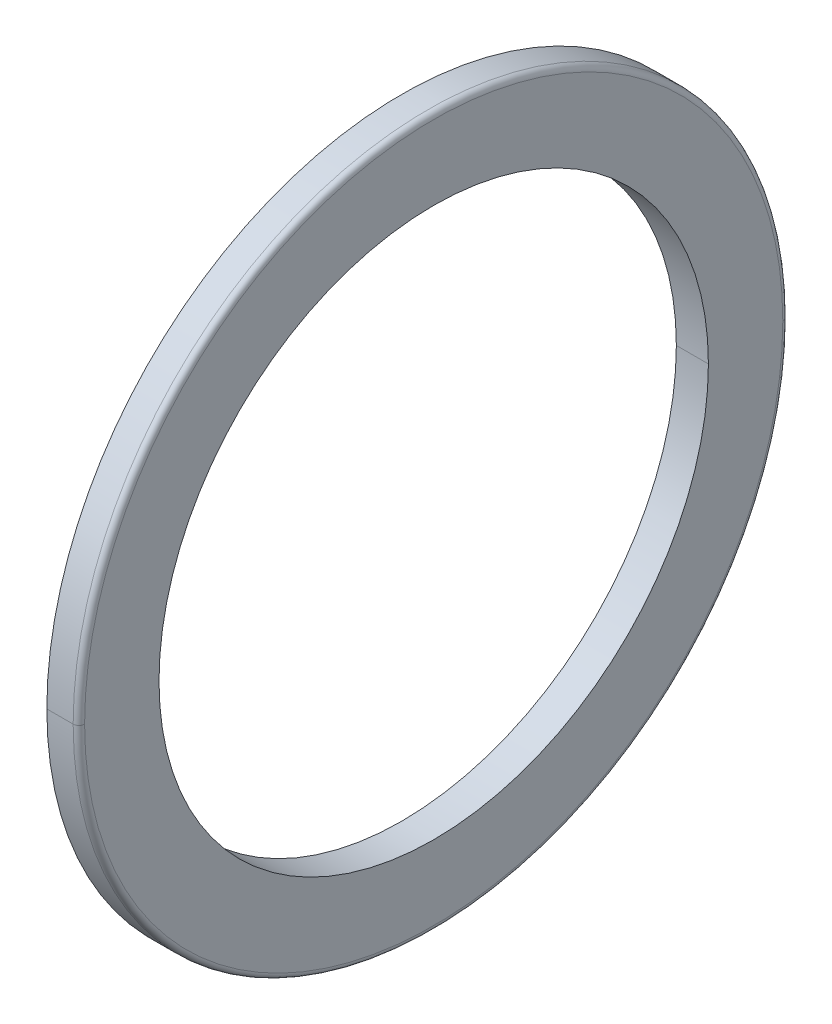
ISO-10303-21;
HEADER;
FILE_DESCRIPTION(('STEP AP214'),'2;1');
FILE_NAME('part.step','',(''),(''),'','','');
FILE_SCHEMA(('AUTOMOTIVE_DESIGN { 1 0 10303 214 1 1 1 1 }'));
ENDSEC;
DATA;
#1=APPLICATION_CONTEXT('core data for automotive mechanical design processes');
#2=APPLICATION_PROTOCOL_DEFINITION('international standard','automotive_design',2000,#1);
#3=PRODUCT_CONTEXT('',#1,'mechanical');
#4=PRODUCT('Part','Part','',(#3));
#5=PRODUCT_RELATED_PRODUCT_CATEGORY('part','',(#4));
#6=PRODUCT_DEFINITION_FORMATION('','',#4);
#7=PRODUCT_DEFINITION_CONTEXT('part definition',#1,'design');
#8=PRODUCT_DEFINITION('design','',#6,#7);
#9=PRODUCT_DEFINITION_SHAPE('','',#8);
#10=(LENGTH_UNIT() NAMED_UNIT(*) SI_UNIT(.MILLI.,.METRE.));
#11=(NAMED_UNIT(*) PLANE_ANGLE_UNIT() SI_UNIT($,.RADIAN.));
#12=(NAMED_UNIT(*) SI_UNIT($,.STERADIAN.) SOLID_ANGLE_UNIT());
#13=UNCERTAINTY_MEASURE_WITH_UNIT(LENGTH_MEASURE(1.E-05),#10,'distance_accuracy_value','');
#14=(GEOMETRIC_REPRESENTATION_CONTEXT(3) GLOBAL_UNCERTAINTY_ASSIGNED_CONTEXT((#13)) GLOBAL_UNIT_ASSIGNED_CONTEXT((#10,
#11,#12)) REPRESENTATION_CONTEXT('',''));
#15=CARTESIAN_POINT('',(0.,0.,0.));
#16=DIRECTION('',(0.,0.,1.));
#17=DIRECTION('',(1.,0.,0.));
#18=AXIS2_PLACEMENT_3D('',#15,#16,#17);
#19=CARTESIAN_POINT('',(7.,0.,0.));
#20=DIRECTION('',(-1.,0.,0.));
#21=DIRECTION('',(0.,1.,0.));
#22=AXIS2_PLACEMENT_3D('',#19,#20,#21);
#23=CYLINDRICAL_SURFACE('',#22,77.5);
#24=CARTESIAN_POINT('',(18.,0.,0.));
#25=DIRECTION('',(1.,0.,0.));
#26=DIRECTION('',(0.,0.,-1.));
#27=AXIS2_PLACEMENT_3D('',#24,#25,#26);
#28=CIRCLE('',#27,77.5);
#29=CARTESIAN_POINT('',(18.,0.,77.5));
#30=VERTEX_POINT('',#29);
#31=CARTESIAN_POINT('',(18.,0.,-77.5));
#32=VERTEX_POINT('',#31);
#33=EDGE_CURVE('E11',#30,#32,#28,.T.);
#34=ORIENTED_EDGE('',*,*,#33,.T.);
#35=CARTESIAN_POINT('',(23.7499999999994,0.,-77.5));
#36=DIRECTION('',(-1.,0.,0.));
#37=VECTOR('',#36,1.);
#38=LINE('',#35,#37);
#39=CARTESIAN_POINT('',(23.7499999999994,0.,-77.5));
#40=VERTEX_POINT('',#39);
#41=EDGE_CURVE('E26',#40,#32,#38,.T.);
#42=ORIENTED_EDGE('',*,*,#41,.F.);
#43=CARTESIAN_POINT('',(23.7499999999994,0.,0.));
#44=DIRECTION('',(1.,0.,0.));
#45=DIRECTION('',(0.,0.,-1.));
#46=AXIS2_PLACEMENT_3D('',#43,#44,#45);
#47=CIRCLE('',#46,77.5);
#48=CARTESIAN_POINT('',(23.7499999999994,0.,77.5));
#49=VERTEX_POINT('',#48);
#50=EDGE_CURVE('E75',#49,#40,#47,.T.);
#51=ORIENTED_EDGE('',*,*,#50,.F.);
#52=CARTESIAN_POINT('',(23.7499999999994,0.,77.5));
#53=DIRECTION('',(-1.,0.,0.));
#54=VECTOR('',#53,1.);
#55=LINE('',#52,#54);
#56=EDGE_CURVE('E195',#49,#30,#55,.T.);
#57=ORIENTED_EDGE('',*,*,#56,.T.);
#58=EDGE_LOOP('',(#34,#42,#51,#57));
#59=FACE_BOUND('',#58,.T.);
#60=ADVANCED_FACE('F17',(#59),#23,.T.);
#61=CARTESIAN_POINT('',(7.,0.,0.));
#62=DIRECTION('',(-1.,0.,0.));
#63=DIRECTION('',(0.,-1.,0.));
#64=AXIS2_PLACEMENT_3D('',#61,#62,#63);
#65=CYLINDRICAL_SURFACE('',#64,77.5);
#66=CARTESIAN_POINT('',(23.7499999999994,0.,0.));
#67=DIRECTION('',(1.,0.,0.));
#68=DIRECTION('',(0.,0.,-1.));
#69=AXIS2_PLACEMENT_3D('',#66,#67,#68);
#70=CIRCLE('',#69,77.5);
#71=EDGE_CURVE('E193',#40,#49,#70,.T.);
#72=ORIENTED_EDGE('',*,*,#71,.F.);
#73=ORIENTED_EDGE('',*,*,#41,.T.);
#74=CARTESIAN_POINT('',(18.,0.,0.));
#75=DIRECTION('',(1.,0.,0.));
#76=DIRECTION('',(0.,0.,-1.));
#77=AXIS2_PLACEMENT_3D('',#74,#75,#76);
#78=CIRCLE('',#77,77.5);
#79=EDGE_CURVE('E160',#32,#30,#78,.T.);
#80=ORIENTED_EDGE('',*,*,#79,.T.);
#81=ORIENTED_EDGE('',*,*,#56,.F.);
#82=EDGE_LOOP('',(#72,#73,#80,#81));
#83=FACE_BOUND('',#82,.T.);
#84=ADVANCED_FACE('F168',(#83),#65,.T.);
#85=CARTESIAN_POINT('',(18.,77.5,0.));
#86=DIRECTION('',(-1.,0.,0.));
#87=DIRECTION('',(0.,0.,1.));
#88=AXIS2_PLACEMENT_3D('',#85,#86,#87);
#89=PLANE('',#88);
#90=CARTESIAN_POINT('',(18.,0.,0.));
#91=DIRECTION('',(1.,0.,0.));
#92=DIRECTION('',(0.,0.,-1.));
#93=AXIS2_PLACEMENT_3D('',#90,#91,#92);
#94=CIRCLE('',#93,60.);
#95=CARTESIAN_POINT('',(18.,0.,-60.));
#96=VERTEX_POINT('',#95);
#97=CARTESIAN_POINT('',(18.,0.,60.));
#98=VERTEX_POINT('',#97);
#99=EDGE_CURVE('E156',#96,#98,#94,.T.);
#100=ORIENTED_EDGE('',*,*,#99,.T.);
#101=CARTESIAN_POINT('',(18.,0.,0.));
#102=DIRECTION('',(1.,0.,0.));
#103=DIRECTION('',(0.,0.,-1.));
#104=AXIS2_PLACEMENT_3D('',#101,#102,#103);
#105=CIRCLE('',#104,60.);
#106=EDGE_CURVE('E154',#98,#96,#105,.T.);
#107=ORIENTED_EDGE('',*,*,#106,.T.);
#108=EDGE_LOOP('',(#100,#107));
#109=FACE_BOUND('',#108,.T.);
#110=ORIENTED_EDGE('',*,*,#79,.F.);
#111=ORIENTED_EDGE('',*,*,#33,.F.);
#112=EDGE_LOOP('',(#110,#111));
#113=FACE_BOUND('',#112,.T.);
#114=ADVANCED_FACE('F176',(#109,#113),#89,.T.);
#115=CARTESIAN_POINT('',(7.,0.,0.));
#116=DIRECTION('',(-1.,0.,0.));
#117=DIRECTION('',(0.,1.,0.));
#118=AXIS2_PLACEMENT_3D('',#115,#116,#117);
#119=CYLINDRICAL_SURFACE('',#118,60.);
#120=ORIENTED_EDGE('',*,*,#106,.F.);
#121=CARTESIAN_POINT('',(25.,0.,60.));
#122=DIRECTION('',(-1.,0.,0.));
#123=VECTOR('',#122,1.);
#124=LINE('',#121,#123);
#125=CARTESIAN_POINT('',(25.,0.,60.));
#126=VERTEX_POINT('',#125);
#127=EDGE_CURVE('E125',#126,#98,#124,.T.);
#128=ORIENTED_EDGE('',*,*,#127,.F.);
#129=CARTESIAN_POINT('',(25.,0.,0.));
#130=DIRECTION('',(1.,0.,0.));
#131=DIRECTION('',(0.,0.,-1.));
#132=AXIS2_PLACEMENT_3D('',#129,#130,#131);
#133=CIRCLE('',#132,60.);
#134=CARTESIAN_POINT('',(25.,0.,-60.));
#135=VERTEX_POINT('',#134);
#136=EDGE_CURVE('E141',#126,#135,#133,.T.);
#137=ORIENTED_EDGE('',*,*,#136,.T.);
#138=CARTESIAN_POINT('',(25.,0.,-60.));
#139=DIRECTION('',(-1.,0.,0.));
#140=VECTOR('',#139,1.);
#141=LINE('',#138,#140);
#142=EDGE_CURVE('E86',#135,#96,#141,.T.);
#143=ORIENTED_EDGE('',*,*,#142,.T.);
#144=EDGE_LOOP('',(#120,#128,#137,#143));
#145=FACE_BOUND('',#144,.T.);
#146=ADVANCED_FACE('F109',(#145),#119,.F.);
#147=CARTESIAN_POINT('',(7.,0.,0.));
#148=DIRECTION('',(-1.,0.,0.));
#149=DIRECTION('',(0.,-1.,0.));
#150=AXIS2_PLACEMENT_3D('',#147,#148,#149);
#151=CYLINDRICAL_SURFACE('',#150,60.);
#152=CARTESIAN_POINT('',(25.,0.,0.));
#153=DIRECTION('',(1.,0.,0.));
#154=DIRECTION('',(0.,0.,-1.));
#155=AXIS2_PLACEMENT_3D('',#152,#153,#154);
#156=CIRCLE('',#155,60.);
#157=EDGE_CURVE('E83',#135,#126,#156,.T.);
#158=ORIENTED_EDGE('',*,*,#157,.T.);
#159=ORIENTED_EDGE('',*,*,#127,.T.);
#160=ORIENTED_EDGE('',*,*,#99,.F.);
#161=ORIENTED_EDGE('',*,*,#142,.F.);
#162=EDGE_LOOP('',(#158,#159,#160,#161));
#163=FACE_BOUND('',#162,.T.);
#164=ADVANCED_FACE('F99',(#163),#151,.F.);
#165=CARTESIAN_POINT('',(25.,60.,0.));
#166=DIRECTION('',(1.,0.,0.));
#167=DIRECTION('',(0.,0.,-1.));
#168=AXIS2_PLACEMENT_3D('',#165,#166,#167);
#169=PLANE('',#168);
#170=CARTESIAN_POINT('',(25.,0.,0.));
#171=DIRECTION('',(1.,0.,0.));
#172=DIRECTION('',(0.,0.,-1.));
#173=AXIS2_PLACEMENT_3D('',#170,#171,#172);
#174=CIRCLE('',#173,76.25);
#175=CARTESIAN_POINT('',(25.,0.,-76.25));
#176=VERTEX_POINT('',#175);
#177=CARTESIAN_POINT('',(25.,0.,76.25));
#178=VERTEX_POINT('',#177);
#179=EDGE_CURVE('E65',#176,#178,#174,.T.);
#180=ORIENTED_EDGE('',*,*,#179,.T.);
#181=CARTESIAN_POINT('',(25.,0.,0.));
#182=DIRECTION('',(1.,0.,0.));
#183=DIRECTION('',(0.,0.,-1.));
#184=AXIS2_PLACEMENT_3D('',#181,#182,#183);
#185=CIRCLE('',#184,76.25);
#186=EDGE_CURVE('E60',#178,#176,#185,.T.);
#187=ORIENTED_EDGE('',*,*,#186,.T.);
#188=EDGE_LOOP('',(#180,#187));
#189=FACE_BOUND('',#188,.T.);
#190=ORIENTED_EDGE('',*,*,#157,.F.);
#191=ORIENTED_EDGE('',*,*,#136,.F.);
#192=EDGE_LOOP('',(#190,#191));
#193=FACE_BOUND('',#192,.T.);
#194=ADVANCED_FACE('F62',(#189,#193),#169,.T.);
#195=CARTESIAN_POINT('',(23.7499999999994,0.,0.));
#196=DIRECTION('',(1.,0.,0.));
#197=DIRECTION('',(0.,1.,0.));
#198=AXIS2_PLACEMENT_3D('',#195,#196,#197);
#199=TOROIDAL_SURFACE('',#198,76.2499999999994,1.25000000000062);
#200=ORIENTED_EDGE('',*,*,#50,.T.);
#201=CARTESIAN_POINT('',(23.7499999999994,-2.08275051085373E-13,-77.5));
#202=CARTESIAN_POINT('',(23.7704530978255,-2.28040170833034E-13,-77.500000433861));
#203=CARTESIAN_POINT('',(23.7909061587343,-2.18156261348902E-13,-77.4994980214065));
#204=CARTESIAN_POINT('',(23.831763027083,-1.9838574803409E-13,-77.4974906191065));
#205=CARTESIAN_POINT('',(23.852166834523,-1.88499144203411E-13,-77.4959856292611));
#206=CARTESIAN_POINT('',(23.8928760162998,-2.2801860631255E-13,-77.4919761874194));
#207=CARTESIAN_POINT('',(23.9131813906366,-2.77424672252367E-13,-77.4894717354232));
#208=CARTESIAN_POINT('',(23.9536447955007,-2.76696333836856E-13,-77.4834695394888));
#209=CARTESIAN_POINT('',(23.9738028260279,-2.26561929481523E-13,-77.4799717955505));
#210=CARTESIAN_POINT('',(24.0139229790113,-1.89859077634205E-13,-77.4719914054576));
#211=CARTESIAN_POINT('',(24.0338851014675,-2.03290630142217E-13,-77.4675087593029));
#212=CARTESIAN_POINT('',(24.0735653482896,-2.1305812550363E-13,-77.4575693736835));
#213=CARTESIAN_POINT('',(24.0932834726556,-2.09394068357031E-13,-77.4521126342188));
#214=CARTESIAN_POINT('',(24.1324282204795,-2.06866735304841E-13,-77.4402382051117));
#215=CARTESIAN_POINT('',(24.1518548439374,-2.08003459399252E-13,-77.4338205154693));
#216=CARTESIAN_POINT('',(24.1903697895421,-2.08153903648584E-13,-77.4200396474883));
#217=CARTESIAN_POINT('',(24.2094581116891,-2.07167623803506E-13,-77.4126764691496));
#218=CARTESIAN_POINT('',(24.2472504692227,-2.08871059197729E-13,-77.3970223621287));
#219=CARTESIAN_POINT('',(24.2659545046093,-2.1156077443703E-13,-77.3887314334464));
#220=CARTESIAN_POINT('',(24.3029332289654,-2.04344274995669E-13,-77.3712417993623));
#221=CARTESIAN_POINT('',(24.3212079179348,-1.94438060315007E-13,-77.3620430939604));
#222=CARTESIAN_POINT('',(24.3572839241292,-2.21318723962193E-13,-77.3427600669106));
#223=CARTESIAN_POINT('',(24.3750852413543,-2.5810560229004E-13,-77.3326757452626));
#224=CARTESIAN_POINT('',(24.4101716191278,-2.94840391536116E-13,-77.3116457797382));
#225=CARTESIAN_POINT('',(24.4274566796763,-2.94788302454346E-13,-77.3007001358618));
#226=CARTESIAN_POINT('',(24.4614689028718,-2.57922962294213E-13,-77.2779738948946));
#227=CARTESIAN_POINT('',(24.4781960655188,-2.21109711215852E-13,-77.2661932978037));
#228=CARTESIAN_POINT('',(24.5110521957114,-1.94118230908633E-13,-77.241825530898));
#229=CARTESIAN_POINT('',(24.527181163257,-2.0394000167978E-13,-77.2292383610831));
#230=CARTESIAN_POINT('',(24.5588020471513,-2.11085059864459E-13,-77.2032877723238));
#231=CARTESIAN_POINT('',(24.5742939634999,-2.08408347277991E-13,-77.1899243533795));
#232=CARTESIAN_POINT('',(24.6046034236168,-2.0640132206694E-13,-77.162453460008));
#233=CARTESIAN_POINT('',(24.6194209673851,-2.07071009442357E-13,-77.1483459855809));
#234=CARTESIAN_POINT('',(24.6483459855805,-2.07511274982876E-13,-77.1194209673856));
#235=CARTESIAN_POINT('',(24.6624534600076,-2.07281853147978E-13,-77.1046034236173));
#236=CARTESIAN_POINT('',(24.6899243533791,-2.07061601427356E-13,-77.0742939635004));
#237=CARTESIAN_POINT('',(24.7032877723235,-2.07070771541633E-13,-77.0588020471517));
#238=CARTESIAN_POINT('',(24.7292383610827,-2.07022983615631E-13,-77.0271811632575));
#239=CARTESIAN_POINT('',(24.7418255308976,-2.06966025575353E-13,-77.0110521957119));
#240=CARTESIAN_POINT('',(24.7661932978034,-2.06867762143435E-13,-76.9781960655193));
#241=CARTESIAN_POINT('',(24.7779738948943,-2.06826456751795E-13,-76.9614689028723));
#242=CARTESIAN_POINT('',(24.8007001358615,-2.06737721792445E-13,-76.9274566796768));
#243=CARTESIAN_POINT('',(24.8116457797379,-2.06690292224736E-13,-76.9101716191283));
#244=CARTESIAN_POINT('',(24.8326757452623,-2.06595284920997E-13,-76.8750852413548));
#245=CARTESIAN_POINT('',(24.8427600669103,-2.06547707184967E-13,-76.8572839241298));
#246=CARTESIAN_POINT('',(24.8620430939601,-2.06450947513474E-13,-76.8212079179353));
#247=CARTESIAN_POINT('',(24.871241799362,-2.06401765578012E-13,-76.8029332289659));
#248=CARTESIAN_POINT('',(24.8887314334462,-2.06302336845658E-13,-76.7659545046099));
#249=CARTESIAN_POINT('',(24.8970223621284,-2.06252090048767E-13,-76.7472504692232));
#250=CARTESIAN_POINT('',(24.9126764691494,-2.06150539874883E-13,-76.7094581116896));
#251=CARTESIAN_POINT('',(24.9200396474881,-2.06099236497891E-13,-76.6903697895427));
#252=CARTESIAN_POINT('',(24.9338205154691,-2.05995726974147E-13,-76.6518548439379));
#253=CARTESIAN_POINT('',(24.9402382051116,-2.05943520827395E-13,-76.6324282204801));
#254=CARTESIAN_POINT('',(24.9521126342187,-2.05838323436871E-13,-76.5932834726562));
#255=CARTESIAN_POINT('',(24.9575693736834,-2.05785332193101E-13,-76.5735653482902));
#256=CARTESIAN_POINT('',(24.9675087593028,-2.0567869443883E-13,-76.533885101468));
#257=CARTESIAN_POINT('',(24.9719914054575,-2.05625047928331E-13,-76.5139229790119));
#258=CARTESIAN_POINT('',(24.9799717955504,-2.05517228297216E-13,-76.4738028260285));
#259=CARTESIAN_POINT('',(24.9834695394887,-2.054630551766E-13,-76.4536447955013));
#260=CARTESIAN_POINT('',(24.9894717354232,-2.05354312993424E-13,-76.4131813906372));
#261=CARTESIAN_POINT('',(24.9919761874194,-2.05299743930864E-13,-76.3928760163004));
#262=CARTESIAN_POINT('',(24.995985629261,-2.05190341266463E-13,-76.3521668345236));
#263=CARTESIAN_POINT('',(24.9974906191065,-2.05135507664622E-13,-76.3317630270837));
#264=CARTESIAN_POINT('',(24.9994980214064,-2.05025708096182E-13,-76.2909061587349));
#265=CARTESIAN_POINT('',(25.000000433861,-2.04970742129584E-13,-76.2704530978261));
#266=CARTESIAN_POINT('',(25.,-2.04915776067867E-13,-76.25));
#267=B_SPLINE_CURVE_WITH_KNOTS('',3,(#201,#202,#203,#204,#205,#206,#207,#208,#209,#210,#211,
#212,#213,#214,#215,#216,#217,#218,#219,#220,#221,#222,#223,#224,#225,#226,#227,#228,#229,#230,
#231,#232,#233,#234,#235,#236,#237,#238,#239,#240,#241,#242,#243,#244,#245,#246,#247,#248,#249,
#250,#251,#252,#253,#254,#255,#256,#257,#258,#259,#260,#261,#262,#263,#264,#265,#266),
.UNSPECIFIED.,.F.,.F.,(4,2,2,2,2,2,2,2,2,2,2,2,2,2,2,2,2,2,2,2,2,2,2,2,2,2,2,2,2,2,2,2,4),(0.,
0.0613530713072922,0.122706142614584,0.184059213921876,0.245412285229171,0.306765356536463,
0.368118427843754,0.42947149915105,0.490824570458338,0.552177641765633,0.613530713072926,
0.674883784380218,0.736236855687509,0.797589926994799,0.858942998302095,0.920296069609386,
0.981649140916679,1.04300221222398,1.10435528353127,1.16570835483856,1.22706142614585,
1.28841449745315,1.34976756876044,1.41112064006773,1.47247371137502,1.53382678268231,
1.59517985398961,1.6565329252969,1.7178859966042,1.77923906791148,1.84059213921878,
1.90194521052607,1.96329828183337),.UNSPECIFIED.);
#268=EDGE_CURVE('E69',#40,#176,#267,.T.);
#269=ORIENTED_EDGE('',*,*,#268,.T.);
#270=ORIENTED_EDGE('',*,*,#186,.F.);
#271=CARTESIAN_POINT('',(23.7499999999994,1.29950210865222E-13,77.5));
#272=CARTESIAN_POINT('',(23.7704530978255,1.29950246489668E-13,77.500000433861));
#273=CARTESIAN_POINT('',(23.7909061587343,1.29949386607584E-13,77.4994980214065));
#274=CARTESIAN_POINT('',(23.831763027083,1.29945985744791E-13,77.4974906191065));
#275=CARTESIAN_POINT('',(23.852166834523,1.29943444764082E-13,77.4959856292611));
#276=CARTESIAN_POINT('',(23.8928760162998,1.2993679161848E-13,77.4919761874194));
#277=CARTESIAN_POINT('',(23.9131813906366,1.29932679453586E-13,77.4894717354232));
#278=CARTESIAN_POINT('',(23.9536447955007,1.29922370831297E-13,77.4834695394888));
#279=CARTESIAN_POINT('',(23.9738028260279,1.29916174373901E-13,77.4799717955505));
#280=CARTESIAN_POINT('',(24.0139229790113,1.29903700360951E-13,77.4719914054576));
#281=CARTESIAN_POINT('',(24.0338851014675,1.29897422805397E-13,77.4675087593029));
#282=CARTESIAN_POINT('',(24.0735653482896,1.29877371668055E-13,77.4575693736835));
#283=CARTESIAN_POINT('',(24.0932834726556,1.29863598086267E-13,77.4521126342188));
#284=CARTESIAN_POINT('',(24.1324282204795,1.29856320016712E-13,77.4402382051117));
#285=CARTESIAN_POINT('',(24.1518548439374,1.29862815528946E-13,77.4338205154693));
#286=CARTESIAN_POINT('',(24.1903697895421,1.29792562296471E-13,77.4200396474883));
#287=CARTESIAN_POINT('',(24.2094581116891,1.29715813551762E-13,77.4126764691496));
#288=CARTESIAN_POINT('',(24.2472504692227,1.29865515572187E-13,77.3970223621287));
#289=CARTESIAN_POINT('',(24.2659545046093,1.30091966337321E-13,77.3887314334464));
#290=CARTESIAN_POINT('',(24.3029332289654,1.2940598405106E-13,77.3712417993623));
#291=CARTESIAN_POINT('',(24.3212079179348,1.28493550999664E-13,77.3620430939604));
#292=CARTESIAN_POINT('',(24.3572839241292,1.30911891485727E-13,77.3427600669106));
#293=CARTESIAN_POINT('',(24.3750852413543,1.34242665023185E-13,77.3326757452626));
#294=CARTESIAN_POINT('',(24.4101716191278,1.25061363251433E-13,77.3116457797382));
#295=CARTESIAN_POINT('',(24.4274566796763,1.12549287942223E-13,77.3007001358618));
#296=CARTESIAN_POINT('',(24.4614689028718,1.46644664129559E-13,77.2779738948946));
#297=CARTESIAN_POINT('',(24.4781960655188,1.93252115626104E-13,77.2661932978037));
#298=CARTESIAN_POINT('',(24.5110521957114,2.03054051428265E-13,77.241825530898));
#299=CARTESIAN_POINT('',(24.527181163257,1.66248535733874E-13,77.2292383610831));
#300=CARTESIAN_POINT('',(24.5588020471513,0.,77.2032877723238));
#301=CARTESIAN_POINT('',(24.5742939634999,0.,77.1899243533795));
#302=CARTESIAN_POINT('',(24.6046034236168,0.,77.162453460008));
#303=CARTESIAN_POINT('',(24.6194209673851,1.12313673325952E-13,77.1483459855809));
#304=CARTESIAN_POINT('',(24.6483459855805,1.46358956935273E-13,77.1194209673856));
#305=CARTESIAN_POINT('',(24.6624534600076,1.33854922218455E-13,77.1046034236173));
#306=CARTESIAN_POINT('',(24.6899243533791,1.24668693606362E-13,77.0742939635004));
#307=CARTESIAN_POINT('',(24.7032877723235,1.27986499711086E-13,77.0588020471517));
#308=CARTESIAN_POINT('',(24.7292383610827,1.30381319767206E-13,77.0271811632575));
#309=CARTESIAN_POINT('',(24.7418255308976,1.29458333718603E-13,77.0110521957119));
#310=CARTESIAN_POINT('',(24.7661932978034,1.28747282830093E-13,76.9781960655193));
#311=CARTESIAN_POINT('',(24.7779738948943,1.28959217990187E-13,76.9614689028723));
#312=CARTESIAN_POINT('',(24.8007001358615,1.29078179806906E-13,76.9274566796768));
#313=CARTESIAN_POINT('',(24.8116457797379,1.28985206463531E-13,76.9101716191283));
#314=CARTESIAN_POINT('',(24.8326757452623,1.28878362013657E-13,76.8750852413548));
#315=CARTESIAN_POINT('',(24.8427600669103,1.28864490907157E-13,76.8572839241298));
#316=CARTESIAN_POINT('',(24.8620430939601,1.28820056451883E-13,76.8212079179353));
#317=CARTESIAN_POINT('',(24.871241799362,1.28789493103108E-13,76.8029332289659));
#318=CARTESIAN_POINT('',(24.8887314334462,1.28711272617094E-13,76.7659545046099));
#319=CARTESIAN_POINT('',(24.8970223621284,1.28663615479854E-13,76.7472504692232));
#320=CARTESIAN_POINT('',(24.9126764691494,1.28649050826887E-13,76.7094581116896));
#321=CARTESIAN_POINT('',(24.9200396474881,1.28682143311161E-13,76.6903697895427));
#322=CARTESIAN_POINT('',(24.9338205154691,1.28438558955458E-13,76.6518548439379));
#323=CARTESIAN_POINT('',(24.9402382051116,1.28161882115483E-13,76.6324282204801));
#324=CARTESIAN_POINT('',(24.9521126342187,1.28763453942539E-13,76.5932834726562));
#325=CARTESIAN_POINT('',(24.9575693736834,1.2964170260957E-13,76.5735653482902));
#326=CARTESIAN_POINT('',(24.9675087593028,1.27085335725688E-13,76.533885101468));
#327=CARTESIAN_POINT('',(24.9719914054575,1.23650720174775E-13,76.5139229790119));
#328=CARTESIAN_POINT('',(24.9799717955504,1.32875566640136E-13,76.4738028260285));
#329=CARTESIAN_POINT('',(24.9834695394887,1.45535028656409E-13,76.4536447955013));
#330=CARTESIAN_POINT('',(24.9894717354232,1.10788536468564E-13,76.4131813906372));
#331=CARTESIAN_POINT('',(24.9919761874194,0.,76.3928760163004));
#332=CARTESIAN_POINT('',(24.995985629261,0.,76.3521668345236));
#333=CARTESIAN_POINT('',(24.9974906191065,0.,76.3317630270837));
#334=CARTESIAN_POINT('',(24.9994980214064,1.57746939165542E-13,76.2909061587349));
#335=CARTESIAN_POINT('',(25.000000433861,1.7623134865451E-13,76.2704530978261));
#336=CARTESIAN_POINT('',(25.,1.27854239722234E-13,76.25));
#337=B_SPLINE_CURVE_WITH_KNOTS('',3,(#271,#272,#273,#274,#275,#276,#277,#278,#279,#280,#281,
#282,#283,#284,#285,#286,#287,#288,#289,#290,#291,#292,#293,#294,#295,#296,#297,#298,#299,#300,
#301,#302,#303,#304,#305,#306,#307,#308,#309,#310,#311,#312,#313,#314,#315,#316,#317,#318,#319,
#320,#321,#322,#323,#324,#325,#326,#327,#328,#329,#330,#331,#332,#333,#334,#335,#336),
.UNSPECIFIED.,.F.,.F.,(4,2,2,2,2,2,2,2,2,2,2,2,2,2,2,2,2,2,2,2,2,2,2,2,2,2,2,2,2,2,2,2,4),(0.,
0.0613530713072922,0.122706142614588,0.184059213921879,0.245412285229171,0.306765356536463,
0.368118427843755,0.42947149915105,0.490824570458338,0.552177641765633,0.613530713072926,
0.674883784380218,0.736236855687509,0.797589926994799,0.858942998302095,0.920296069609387,
0.981649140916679,1.04300221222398,1.10435528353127,1.16570835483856,1.22706142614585,
1.28841449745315,1.34976756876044,1.41112064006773,1.47247371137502,1.53382678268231,
1.59517985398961,1.6565329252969,1.7178859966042,1.77923906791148,1.84059213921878,
1.90194521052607,1.96329828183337),.UNSPECIFIED.);
#338=EDGE_CURVE('E79',#49,#178,#337,.T.);
#339=ORIENTED_EDGE('',*,*,#338,.F.);
#340=EDGE_LOOP('',(#200,#269,#270,#339));
#341=FACE_BOUND('',#340,.T.);
#342=ADVANCED_FACE('F74',(#341),#199,.T.);
#343=CARTESIAN_POINT('',(23.7499999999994,0.,0.));
#344=DIRECTION('',(1.,0.,0.));
#345=DIRECTION('',(0.,-1.,0.));
#346=AXIS2_PLACEMENT_3D('',#343,#344,#345);
#347=TOROIDAL_SURFACE('',#346,76.2499999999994,1.25000000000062);
#348=ORIENTED_EDGE('',*,*,#179,.F.);
#349=ORIENTED_EDGE('',*,*,#268,.F.);
#350=ORIENTED_EDGE('',*,*,#71,.T.);
#351=ORIENTED_EDGE('',*,*,#338,.T.);
#352=EDGE_LOOP('',(#348,#349,#350,#351));
#353=FACE_BOUND('',#352,.T.);
#354=ADVANCED_FACE('F81',(#353),#347,.T.);
#355=CLOSED_SHELL('',(#60,#84,#114,#146,#164,#194,#342,#354));
#356=MANIFOLD_SOLID_BREP('B1',#355);
#357=ADVANCED_BREP_SHAPE_REPRESENTATION('',(#18,#356),#14);
#358=SHAPE_DEFINITION_REPRESENTATION(#9,#357);
ENDSEC;
END-ISO-10303-21;
